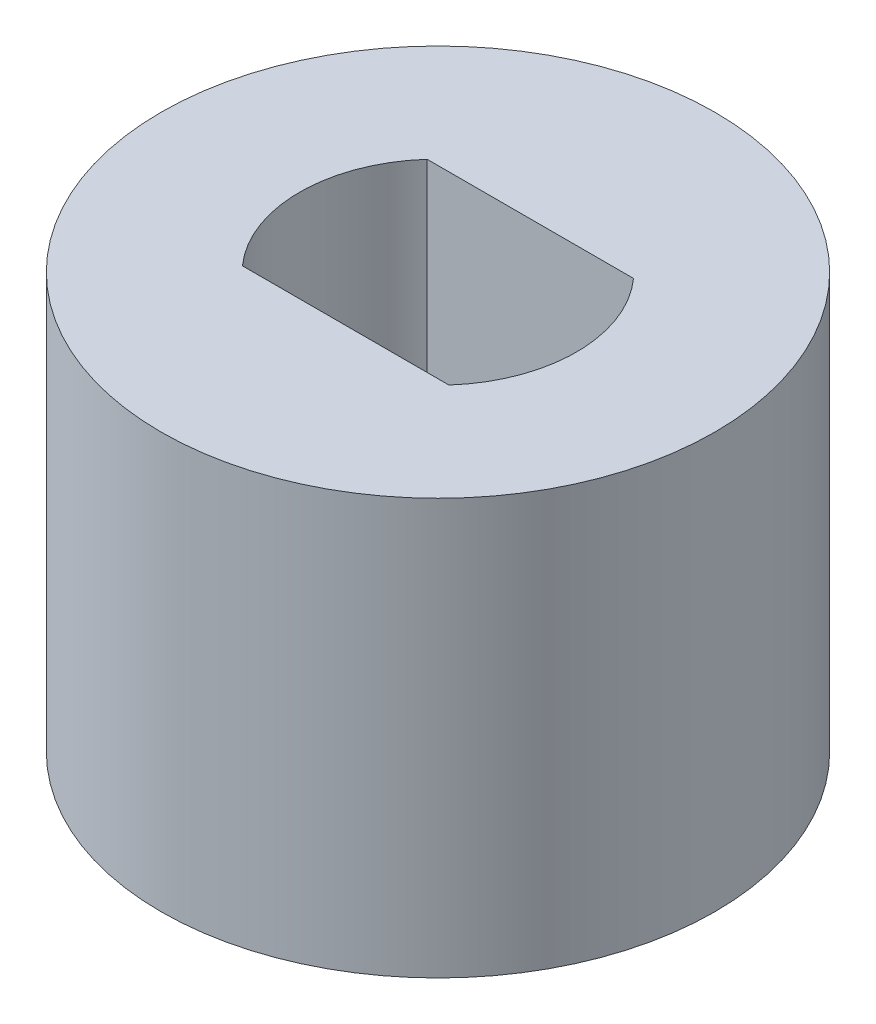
from build123d import *

# Parameters (mm, degrees)
SKETCH2_R           = 6
SKETCH2_R_2         = 3
BOSS_EXTRUDE1_DEPTH = 7
BOSS_EXTRUDE2_START = 2
SKETCH3_R           = 6
BOSS_EXTRUDE2_DEPTH = 2


with BuildPart() as part:
    # Sketch2 → Boss-Extrude1 (new body)
    # profile 1 of 3: a face of its own
    with BuildSketch(Plane(origin=(0, 0, 0), x_dir=(1, 0, 0), z_dir=(0, 1, 0))):
        with Locations(Location((0, 0, 0), (0, 0, 270))):
            Circle(SKETCH2_R)
        Circle(SKETCH2_R_2, mode=Mode.SUBTRACT)
    # profile 2 of 3: a face of its own
    with BuildSketch(Plane(origin=(0, 0, 0), x_dir=(1, 0, 0), z_dir=(0, 1, 0))):
        with BuildLine():
            ThreePointArc((2.236067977, 2), (0, 3), (-2.236067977, 2))
            Line((-2.236067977, 2), (2.236067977, 2))
        make_face()
    # profile 3 of 3: a face of its own
    with BuildSketch(Plane(origin=(0, 0, 0), x_dir=(1, 0, 0), z_dir=(0, 1, 0))):
        with BuildLine():
            Line((2.236067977, -2), (-2.236067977, -2))
            ThreePointArc((-2.236067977, -2), (0, -3), (2.236067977, -2))
        make_face()
    extrude(amount=BOSS_EXTRUDE1_DEPTH)

    # Sketch3 → Boss-Extrude2 (add)
    with BuildSketch(Plane(origin=(0, 0, 0), x_dir=(-1, 0, 0), z_dir=(0, -1, 0)).offset(BOSS_EXTRUDE2_START)):
        with Locations(Location((0, 0, 0), (0, 0, 90))):
            Circle(SKETCH3_R)
    extrude(amount=-BOSS_EXTRUDE2_DEPTH)


solid = part.part
